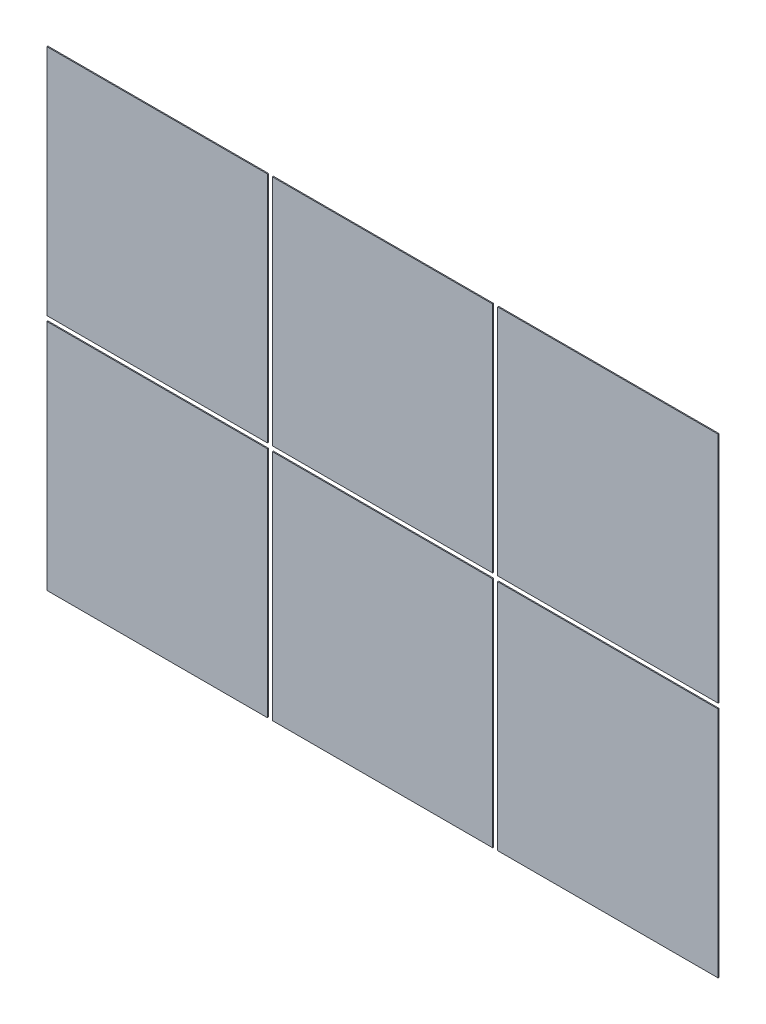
from build123d import *

# Parameters (mm, degrees)
SKETCH1_W             = 880
SKETCH1_H             = 930
BOSS_EXTRUDE1_DEPTH   = 4
BOSS_EXTRUDE1_2_DEPTH = 4
BOSS_EXTRUDE1_3_DEPTH = 4
BOSS_EXTRUDE1_4_DEPTH = 4
BOSS_EXTRUDE1_5_DEPTH = 4
BOSS_EXTRUDE1_6_DEPTH = 4


with BuildPart() as part:
    # Sketch1 → Boss-Extrude1 (new body)
    with BuildSketch(Plane(origin=(0, 0, 4.1), x_dir=(-1, 0, 0), z_dir=(0, 0, -1))):
        with Locations((-900, -475)):
            Rectangle(SKETCH1_W, SKETCH1_H)
    extrude(amount=BOSS_EXTRUDE1_DEPTH)


with BuildPart() as body_2:
    # Sketch1 → Boss-Extrude1 2 (new body)
    with BuildSketch(Plane(origin=(0, 0, 4.1), x_dir=(-1, 0, 0), z_dir=(0, 0, -1))):
        with Locations((0, -475)):
            Rectangle(SKETCH1_W, SKETCH1_H)
    extrude(amount=BOSS_EXTRUDE1_2_DEPTH)


with BuildPart() as body_3:
    # Sketch1 → Boss-Extrude1 3 (new body)
    with BuildSketch(Plane(origin=(0, 0, 4.1), x_dir=(-1, 0, 0), z_dir=(0, 0, -1))):
        with Locations((900, -475)):
            Rectangle(SKETCH1_W, SKETCH1_H)
    extrude(amount=BOSS_EXTRUDE1_3_DEPTH)


with BuildPart() as body_4:
    # Sketch1 → Boss-Extrude1 4 (new body)
    with BuildSketch(Plane(origin=(0, 0, 4.1), x_dir=(-1, 0, 0), z_dir=(0, 0, -1))):
        with Locations((-900, -1425)):
            Rectangle(SKETCH1_W, SKETCH1_H)
    extrude(amount=BOSS_EXTRUDE1_4_DEPTH)


with BuildPart() as body_5:
    # Sketch1 → Boss-Extrude1 5 (new body)
    with BuildSketch(Plane(origin=(0, 0, 4.1), x_dir=(-1, 0, 0), z_dir=(0, 0, -1))):
        with Locations((0, -1425)):
            Rectangle(SKETCH1_W, SKETCH1_H)
    extrude(amount=BOSS_EXTRUDE1_5_DEPTH)


with BuildPart() as body_6:
    # Sketch1 → Boss-Extrude1 6 (new body)
    with BuildSketch(Plane(origin=(0, 0, 4.1), x_dir=(-1, 0, 0), z_dir=(0, 0, -1))):
        with Locations((900, -1425)):
            Rectangle(SKETCH1_W, SKETCH1_H)
    extrude(amount=BOSS_EXTRUDE1_6_DEPTH)


solid = Compound([part.part, body_2.part, body_3.part, body_4.part, body_5.part, body_6.part])
